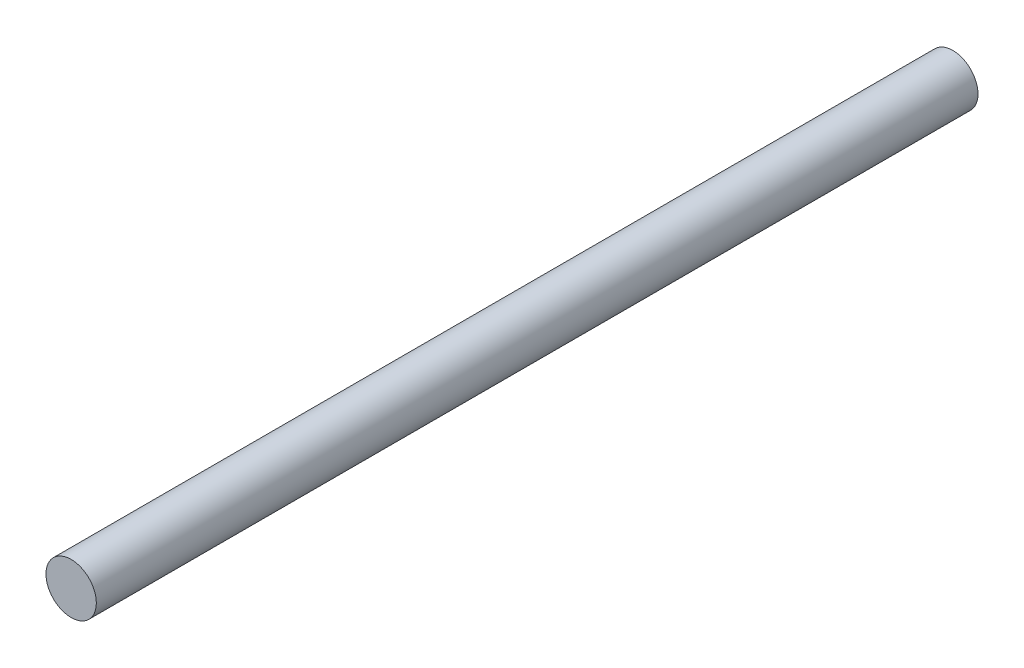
ISO-10303-21;
HEADER;
FILE_DESCRIPTION(('STEP AP214'),'2;1');
FILE_NAME('part.step','',(''),(''),'','','');
FILE_SCHEMA(('AUTOMOTIVE_DESIGN { 1 0 10303 214 1 1 1 1 }'));
ENDSEC;
DATA;
#1=APPLICATION_CONTEXT('core data for automotive mechanical design processes');
#2=APPLICATION_PROTOCOL_DEFINITION('international standard','automotive_design',2000,#1);
#3=PRODUCT_CONTEXT('',#1,'mechanical');
#4=PRODUCT('Part','Part','',(#3));
#5=PRODUCT_RELATED_PRODUCT_CATEGORY('part','',(#4));
#6=PRODUCT_DEFINITION_FORMATION('','',#4);
#7=PRODUCT_DEFINITION_CONTEXT('part definition',#1,'design');
#8=PRODUCT_DEFINITION('design','',#6,#7);
#9=PRODUCT_DEFINITION_SHAPE('','',#8);
#10=(LENGTH_UNIT() NAMED_UNIT(*) SI_UNIT(.MILLI.,.METRE.));
#11=(NAMED_UNIT(*) PLANE_ANGLE_UNIT() SI_UNIT($,.RADIAN.));
#12=(NAMED_UNIT(*) SI_UNIT($,.STERADIAN.) SOLID_ANGLE_UNIT());
#13=UNCERTAINTY_MEASURE_WITH_UNIT(LENGTH_MEASURE(1.E-05),#10,'distance_accuracy_value','');
#14=(GEOMETRIC_REPRESENTATION_CONTEXT(3) GLOBAL_UNCERTAINTY_ASSIGNED_CONTEXT((#13)) GLOBAL_UNIT_ASSIGNED_CONTEXT((#10,
#11,#12)) REPRESENTATION_CONTEXT('',''));
#15=CARTESIAN_POINT('',(0.,0.,0.));
#16=DIRECTION('',(0.,0.,1.));
#17=DIRECTION('',(1.,0.,0.));
#18=AXIS2_PLACEMENT_3D('',#15,#16,#17);
#19=CARTESIAN_POINT('',(0.,0.,-1050.));
#20=DIRECTION('',(0.,0.,1.));
#21=DIRECTION('',(1.,0.,0.));
#22=AXIS2_PLACEMENT_3D('',#19,#20,#21);
#23=CYLINDRICAL_SURFACE('',#22,30.);
#24=CARTESIAN_POINT('',(0.,0.,-1050.));
#25=DIRECTION('',(0.,0.,1.));
#26=DIRECTION('',(1.,0.,0.));
#27=AXIS2_PLACEMENT_3D('',#24,#25,#26);
#28=CIRCLE('',#27,30.);
#29=CARTESIAN_POINT('',(30.,0.,-1050.));
#30=VERTEX_POINT('',#29);
#31=EDGE_CURVE('E10',#30,#30,#28,.T.);
#32=ORIENTED_EDGE('',*,*,#31,.T.);
#33=EDGE_LOOP('',(#32));
#34=FACE_BOUND('',#33,.T.);
#35=CARTESIAN_POINT('',(0.,0.,0.));
#36=DIRECTION('',(0.,0.,1.));
#37=DIRECTION('',(1.,0.,0.));
#38=AXIS2_PLACEMENT_3D('',#35,#36,#37);
#39=CIRCLE('',#38,30.);
#40=CARTESIAN_POINT('',(30.,0.,0.));
#41=VERTEX_POINT('',#40);
#42=EDGE_CURVE('E40',#41,#41,#39,.T.);
#43=ORIENTED_EDGE('',*,*,#42,.F.);
#44=EDGE_LOOP('',(#43));
#45=FACE_BOUND('',#44,.T.);
#46=ADVANCED_FACE('F37',(#34,#45),#23,.T.);
#47=CARTESIAN_POINT('',(0.,0.,-1050.));
#48=DIRECTION('',(0.,0.,1.));
#49=DIRECTION('',(1.,0.,0.));
#50=AXIS2_PLACEMENT_3D('',#47,#48,#49);
#51=PLANE('',#50);
#52=ORIENTED_EDGE('',*,*,#31,.F.);
#53=EDGE_LOOP('',(#52));
#54=FACE_BOUND('',#53,.T.);
#55=ADVANCED_FACE('F54',(#54),#51,.F.);
#56=CARTESIAN_POINT('',(0.,0.,0.));
#57=DIRECTION('',(0.,0.,1.));
#58=DIRECTION('',(1.,0.,0.));
#59=AXIS2_PLACEMENT_3D('',#56,#57,#58);
#60=PLANE('',#59);
#61=ORIENTED_EDGE('',*,*,#42,.T.);
#62=EDGE_LOOP('',(#61));
#63=FACE_BOUND('',#62,.T.);
#64=ADVANCED_FACE('F51',(#63),#60,.T.);
#65=CLOSED_SHELL('',(#46,#55,#64));
#66=MANIFOLD_SOLID_BREP('B2',#65);
#67=ADVANCED_BREP_SHAPE_REPRESENTATION('',(#18,#66),#14);
#68=SHAPE_DEFINITION_REPRESENTATION(#9,#67);
ENDSEC;
END-ISO-10303-21;
